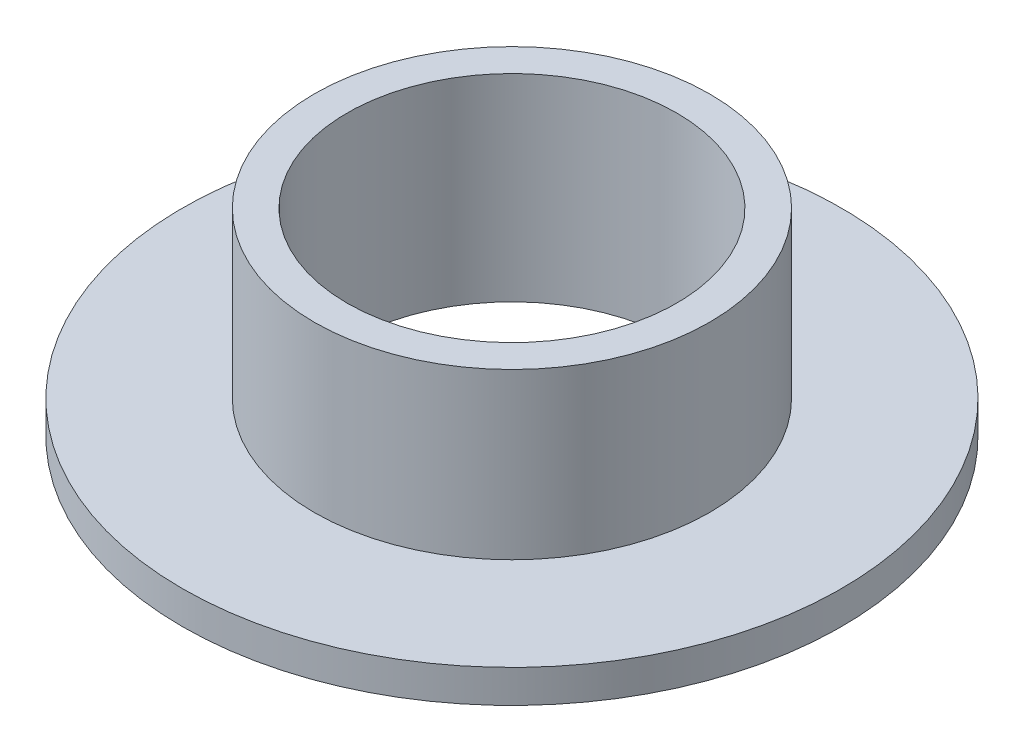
ISO-10303-21;
HEADER;
FILE_DESCRIPTION(('STEP AP214'),'2;1');
FILE_NAME('part.step','',(''),(''),'','','');
FILE_SCHEMA(('AUTOMOTIVE_DESIGN { 1 0 10303 214 1 1 1 1 }'));
ENDSEC;
DATA;
#1=APPLICATION_CONTEXT('core data for automotive mechanical design processes');
#2=APPLICATION_PROTOCOL_DEFINITION('international standard','automotive_design',2000,#1);
#3=PRODUCT_CONTEXT('',#1,'mechanical');
#4=PRODUCT('Part','Part','',(#3));
#5=PRODUCT_RELATED_PRODUCT_CATEGORY('part','',(#4));
#6=PRODUCT_DEFINITION_FORMATION('','',#4);
#7=PRODUCT_DEFINITION_CONTEXT('part definition',#1,'design');
#8=PRODUCT_DEFINITION('design','',#6,#7);
#9=PRODUCT_DEFINITION_SHAPE('','',#8);
#10=(LENGTH_UNIT() NAMED_UNIT(*) SI_UNIT(.MILLI.,.METRE.));
#11=(NAMED_UNIT(*) PLANE_ANGLE_UNIT() SI_UNIT($,.RADIAN.));
#12=(NAMED_UNIT(*) SI_UNIT($,.STERADIAN.) SOLID_ANGLE_UNIT());
#13=UNCERTAINTY_MEASURE_WITH_UNIT(LENGTH_MEASURE(1.E-05),#10,'distance_accuracy_value','');
#14=(GEOMETRIC_REPRESENTATION_CONTEXT(3) GLOBAL_UNCERTAINTY_ASSIGNED_CONTEXT((#13)) GLOBAL_UNIT_ASSIGNED_CONTEXT((#10,
#11,#12)) REPRESENTATION_CONTEXT('',''));
#15=CARTESIAN_POINT('',(0.,0.,0.));
#16=DIRECTION('',(0.,0.,1.));
#17=DIRECTION('',(1.,0.,0.));
#18=AXIS2_PLACEMENT_3D('',#15,#16,#17);
#19=CARTESIAN_POINT('',(0.,5.,0.));
#20=DIRECTION('',(0.,1.,0.));
#21=DIRECTION('',(0.,0.,1.));
#22=AXIS2_PLACEMENT_3D('',#19,#20,#21);
#23=PLANE('',#22);
#24=CARTESIAN_POINT('',(0.,5.,0.));
#25=DIRECTION('',(0.,1.,0.));
#26=DIRECTION('',(0.,0.,1.));
#27=AXIS2_PLACEMENT_3D('',#24,#25,#26);
#28=CIRCLE('',#27,50.);
#29=CARTESIAN_POINT('',(0.,5.,50.));
#30=VERTEX_POINT('',#29);
#31=EDGE_CURVE('E10',#30,#30,#28,.T.);
#32=ORIENTED_EDGE('',*,*,#31,.T.);
#33=EDGE_LOOP('',(#32));
#34=FACE_BOUND('',#33,.T.);
#35=CARTESIAN_POINT('',(0.,5.,0.));
#36=DIRECTION('',(0.,1.,0.));
#37=DIRECTION('',(0.,0.,1.));
#38=AXIS2_PLACEMENT_3D('',#35,#36,#37);
#39=CIRCLE('',#38,30.);
#40=CARTESIAN_POINT('',(0.,5.,30.));
#41=VERTEX_POINT('',#40);
#42=EDGE_CURVE('E48',#41,#41,#39,.T.);
#43=ORIENTED_EDGE('',*,*,#42,.F.);
#44=EDGE_LOOP('',(#43));
#45=FACE_BOUND('',#44,.T.);
#46=ADVANCED_FACE('F32',(#34,#45),#23,.T.);
#47=CARTESIAN_POINT('',(0.,0.,0.));
#48=DIRECTION('',(0.,1.,0.));
#49=DIRECTION('',(0.,0.,1.));
#50=AXIS2_PLACEMENT_3D('',#47,#48,#49);
#51=PLANE('',#50);
#52=CARTESIAN_POINT('',(0.,0.,0.));
#53=DIRECTION('',(0.,1.,0.));
#54=DIRECTION('',(0.,0.,1.));
#55=AXIS2_PLACEMENT_3D('',#52,#53,#54);
#56=CIRCLE('',#55,50.);
#57=CARTESIAN_POINT('',(0.,0.,50.));
#58=VERTEX_POINT('',#57);
#59=EDGE_CURVE('E36',#58,#58,#56,.T.);
#60=ORIENTED_EDGE('',*,*,#59,.F.);
#61=EDGE_LOOP('',(#60));
#62=FACE_BOUND('',#61,.T.);
#63=CARTESIAN_POINT('',(0.,0.,0.));
#64=DIRECTION('',(0.,1.,0.));
#65=DIRECTION('',(0.,0.,1.));
#66=AXIS2_PLACEMENT_3D('',#63,#64,#65);
#67=CIRCLE('',#66,25.);
#68=CARTESIAN_POINT('',(0.,0.,25.));
#69=VERTEX_POINT('',#68);
#70=EDGE_CURVE('E43',#69,#69,#67,.T.);
#71=ORIENTED_EDGE('',*,*,#70,.T.);
#72=EDGE_LOOP('',(#71));
#73=FACE_BOUND('',#72,.T.);
#74=ADVANCED_FACE('F73',(#62,#73),#51,.F.);
#75=CARTESIAN_POINT('',(0.,5.,0.));
#76=DIRECTION('',(0.,-1.,0.));
#77=DIRECTION('',(0.,0.,-1.));
#78=AXIS2_PLACEMENT_3D('',#75,#76,#77);
#79=CYLINDRICAL_SURFACE('',#78,50.);
#80=ORIENTED_EDGE('',*,*,#31,.F.);
#81=EDGE_LOOP('',(#80));
#82=FACE_BOUND('',#81,.T.);
#83=ORIENTED_EDGE('',*,*,#59,.T.);
#84=EDGE_LOOP('',(#83));
#85=FACE_BOUND('',#84,.T.);
#86=ADVANCED_FACE('F34',(#82,#85),#79,.T.);
#87=CARTESIAN_POINT('',(0.,5.,0.));
#88=DIRECTION('',(0.,-1.,0.));
#89=DIRECTION('',(0.,0.,-1.));
#90=AXIS2_PLACEMENT_3D('',#87,#88,#89);
#91=CYLINDRICAL_SURFACE('',#90,25.);
#92=ORIENTED_EDGE('',*,*,#70,.F.);
#93=EDGE_LOOP('',(#92));
#94=FACE_BOUND('',#93,.T.);
#95=CARTESIAN_POINT('',(0.,30.,0.));
#96=DIRECTION('',(0.,1.,0.));
#97=DIRECTION('',(0.,0.,1.));
#98=AXIS2_PLACEMENT_3D('',#95,#96,#97);
#99=CIRCLE('',#98,25.);
#100=CARTESIAN_POINT('',(0.,30.,25.));
#101=VERTEX_POINT('',#100);
#102=EDGE_CURVE('E51',#101,#101,#99,.T.);
#103=ORIENTED_EDGE('',*,*,#102,.T.);
#104=EDGE_LOOP('',(#103));
#105=FACE_BOUND('',#104,.T.);
#106=ADVANCED_FACE('F57',(#94,#105),#91,.F.);
#107=CARTESIAN_POINT('',(0.,30.,0.));
#108=DIRECTION('',(0.,1.,0.));
#109=DIRECTION('',(0.,0.,1.));
#110=AXIS2_PLACEMENT_3D('',#107,#108,#109);
#111=PLANE('',#110);
#112=CARTESIAN_POINT('',(0.,30.,0.));
#113=DIRECTION('',(0.,1.,0.));
#114=DIRECTION('',(0.,0.,1.));
#115=AXIS2_PLACEMENT_3D('',#112,#113,#114);
#116=CIRCLE('',#115,30.);
#117=CARTESIAN_POINT('',(0.,30.,30.));
#118=VERTEX_POINT('',#117);
#119=EDGE_CURVE('E47',#118,#118,#116,.T.);
#120=ORIENTED_EDGE('',*,*,#119,.T.);
#121=EDGE_LOOP('',(#120));
#122=FACE_BOUND('',#121,.T.);
#123=ORIENTED_EDGE('',*,*,#102,.F.);
#124=EDGE_LOOP('',(#123));
#125=FACE_BOUND('',#124,.T.);
#126=ADVANCED_FACE('F59',(#122,#125),#111,.T.);
#127=CARTESIAN_POINT('',(0.,30.,0.));
#128=DIRECTION('',(0.,-1.,0.));
#129=DIRECTION('',(0.,0.,-1.));
#130=AXIS2_PLACEMENT_3D('',#127,#128,#129);
#131=CYLINDRICAL_SURFACE('',#130,30.);
#132=ORIENTED_EDGE('',*,*,#119,.F.);
#133=EDGE_LOOP('',(#132));
#134=FACE_BOUND('',#133,.T.);
#135=ORIENTED_EDGE('',*,*,#42,.T.);
#136=EDGE_LOOP('',(#135));
#137=FACE_BOUND('',#136,.T.);
#138=ADVANCED_FACE('F61',(#134,#137),#131,.T.);
#139=CLOSED_SHELL('',(#46,#74,#86,#106,#126,#138));
#140=MANIFOLD_SOLID_BREP('B2',#139);
#141=ADVANCED_BREP_SHAPE_REPRESENTATION('',(#18,#140),#14);
#142=SHAPE_DEFINITION_REPRESENTATION(#9,#141);
ENDSEC;
END-ISO-10303-21;
